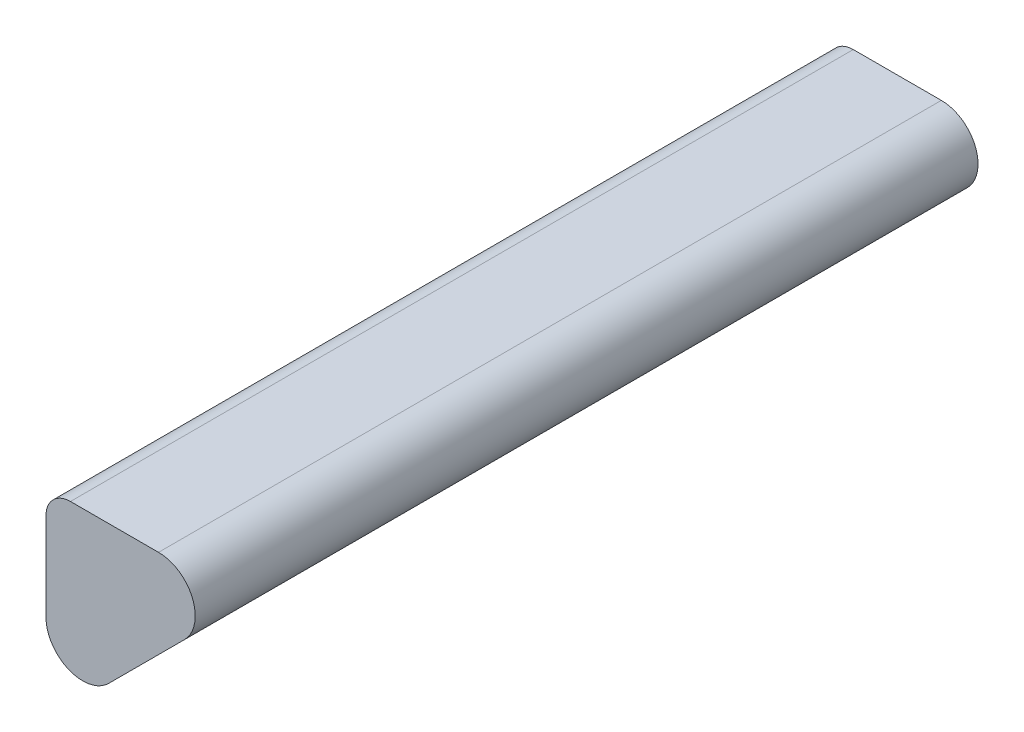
ISO-10303-21;
HEADER;
FILE_DESCRIPTION(('STEP AP214'),'2;1');
FILE_NAME('part.step','',(''),(''),'','','');
FILE_SCHEMA(('AUTOMOTIVE_DESIGN { 1 0 10303 214 1 1 1 1 }'));
ENDSEC;
DATA;
#1=APPLICATION_CONTEXT('core data for automotive mechanical design processes');
#2=APPLICATION_PROTOCOL_DEFINITION('international standard','automotive_design',2000,#1);
#3=PRODUCT_CONTEXT('',#1,'mechanical');
#4=PRODUCT('Part','Part','',(#3));
#5=PRODUCT_RELATED_PRODUCT_CATEGORY('part','',(#4));
#6=PRODUCT_DEFINITION_FORMATION('','',#4);
#7=PRODUCT_DEFINITION_CONTEXT('part definition',#1,'design');
#8=PRODUCT_DEFINITION('design','',#6,#7);
#9=PRODUCT_DEFINITION_SHAPE('','',#8);
#10=(LENGTH_UNIT() NAMED_UNIT(*) SI_UNIT(.MILLI.,.METRE.));
#11=(NAMED_UNIT(*) PLANE_ANGLE_UNIT() SI_UNIT($,.RADIAN.));
#12=(NAMED_UNIT(*) SI_UNIT($,.STERADIAN.) SOLID_ANGLE_UNIT());
#13=UNCERTAINTY_MEASURE_WITH_UNIT(LENGTH_MEASURE(1.E-05),#10,'distance_accuracy_value','');
#14=(GEOMETRIC_REPRESENTATION_CONTEXT(3) GLOBAL_UNCERTAINTY_ASSIGNED_CONTEXT((#13)) GLOBAL_UNIT_ASSIGNED_CONTEXT((#10,
#11,#12)) REPRESENTATION_CONTEXT('',''));
#15=CARTESIAN_POINT('',(0.,0.,0.));
#16=DIRECTION('',(0.,0.,1.));
#17=DIRECTION('',(1.,0.,0.));
#18=AXIS2_PLACEMENT_3D('',#15,#16,#17);
#19=CARTESIAN_POINT('',(-6.50000051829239,3.39949469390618,43.0000000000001));
#20=DIRECTION('',(1.04910532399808E-13,0.,-1.));
#21=DIRECTION('',(-1.,0.,-1.04910532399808E-13));
#22=AXIS2_PLACEMENT_3D('',#19,#20,#21);
#23=CYLINDRICAL_SURFACE('',#22,1.50000000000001);
#24=CARTESIAN_POINT('',(-6.50000051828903,3.39949469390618,11.0000000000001));
#25=DIRECTION('',(1.04910532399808E-13,0.,-1.));
#26=DIRECTION('',(-1.,0.,-1.04910532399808E-13));
#27=AXIS2_PLACEMENT_3D('',#24,#25,#26);
#28=CIRCLE('',#27,1.50000000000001);
#29=CARTESIAN_POINT('',(-5.43934034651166,2.33883452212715,11.));
#30=VERTEX_POINT('',#29);
#31=CARTESIAN_POINT('',(-8.00000051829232,3.39949469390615,10.9999999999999));
#32=VERTEX_POINT('',#31);
#33=EDGE_CURVE('E71',#30,#32,#28,.T.);
#34=ORIENTED_EDGE('',*,*,#33,.F.);
#35=DIRECTION('',(0.,0.,-1.));
#36=VECTOR('',#35,1.);
#37=CARTESIAN_POINT('',(-5.43934034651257,2.33883452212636,42.9999999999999));
#38=LINE('',#37,#36);
#39=CARTESIAN_POINT('',(-5.43934034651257,2.33883452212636,43.));
#40=VERTEX_POINT('',#39);
#41=EDGE_CURVE('E87',#40,#30,#38,.T.);
#42=ORIENTED_EDGE('',*,*,#41,.F.);
#43=CARTESIAN_POINT('',(-6.50000051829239,3.39949469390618,42.9999999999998));
#44=DIRECTION('',(1.04910532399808E-13,0.,-1.));
#45=DIRECTION('',(-1.,0.,-1.04910532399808E-13));
#46=AXIS2_PLACEMENT_3D('',#43,#44,#45);
#47=CIRCLE('',#46,1.50000000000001);
#48=CARTESIAN_POINT('',(-8.00000051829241,3.39949469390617,42.9999999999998));
#49=VERTEX_POINT('',#48);
#50=EDGE_CURVE('E73',#49,#40,#47,.F.);
#51=ORIENTED_EDGE('',*,*,#50,.F.);
#52=DIRECTION('',(0.,0.,1.));
#53=VECTOR('',#52,1.);
#54=CARTESIAN_POINT('',(-8.00000051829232,3.39949469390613,10.9999999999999));
#55=LINE('',#54,#53);
#56=EDGE_CURVE('E20',#32,#49,#55,.T.);
#57=ORIENTED_EDGE('',*,*,#56,.F.);
#58=EDGE_LOOP('',(#34,#42,#51,#57));
#59=FACE_BOUND('',#58,.T.);
#60=ADVANCED_FACE('F16',(#59),#23,.T.);
#61=CARTESIAN_POINT('',(-8.00000051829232,4.11512361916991,9.54638146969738));
#62=DIRECTION('',(-1.,0.,0.));
#63=DIRECTION('',(0.,-0.447213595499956,0.894427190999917));
#64=AXIS2_PLACEMENT_3D('',#61,#62,#63);
#65=PLANE('',#64);
#66=DIRECTION('',(0.,1.,0.));
#67=VECTOR('',#66,1.);
#68=CARTESIAN_POINT('',(-8.00000051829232,3.39949469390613,10.9999999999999));
#69=LINE('',#68,#67);
#70=CARTESIAN_POINT('',(-8.00000051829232,7.00000000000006,10.9999999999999));
#71=VERTEX_POINT('',#70);
#72=EDGE_CURVE('E79',#32,#71,#69,.T.);
#73=ORIENTED_EDGE('',*,*,#72,.F.);
#74=ORIENTED_EDGE('',*,*,#56,.T.);
#75=DIRECTION('',(0.,-1.,0.));
#76=VECTOR('',#75,1.);
#77=CARTESIAN_POINT('',(-8.00000051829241,7.00000000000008,42.9999999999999));
#78=LINE('',#77,#76);
#79=CARTESIAN_POINT('',(-8.0000005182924,7.00000000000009,42.9999999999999));
#80=VERTEX_POINT('',#79);
#81=EDGE_CURVE('E96',#80,#49,#78,.T.);
#82=ORIENTED_EDGE('',*,*,#81,.F.);
#83=DIRECTION('',(0.,0.,1.));
#84=VECTOR('',#83,1.);
#85=CARTESIAN_POINT('',(-8.00000051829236,7.00000000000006,27.));
#86=LINE('',#85,#84);
#87=EDGE_CURVE('E77',#71,#80,#86,.T.);
#88=ORIENTED_EDGE('',*,*,#87,.F.);
#89=EDGE_LOOP('',(#73,#74,#82,#88));
#90=FACE_BOUND('',#89,.T.);
#91=ADVANCED_FACE('F80',(#90),#65,.T.);
#92=CARTESIAN_POINT('',(-7.00000051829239,7.00000000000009,43.));
#93=DIRECTION('',(0.,0.,-1.));
#94=DIRECTION('',(-1.,0.,0.));
#95=AXIS2_PLACEMENT_3D('',#92,#93,#94);
#96=CYLINDRICAL_SURFACE('',#95,0.999999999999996);
#97=CARTESIAN_POINT('',(-7.00000051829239,7.00000000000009,10.9999999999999));
#98=DIRECTION('',(0.,0.,-1.));
#99=DIRECTION('',(-1.,0.,0.));
#100=AXIS2_PLACEMENT_3D('',#97,#98,#99);
#101=CIRCLE('',#100,0.999999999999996);
#102=CARTESIAN_POINT('',(-7.00000051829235,8.00000000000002,10.9999999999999));
#103=VERTEX_POINT('',#102);
#104=EDGE_CURVE('E82',#71,#103,#101,.T.);
#105=ORIENTED_EDGE('',*,*,#104,.F.);
#106=ORIENTED_EDGE('',*,*,#87,.T.);
#107=CARTESIAN_POINT('',(-7.00000051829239,7.00000000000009,42.9999999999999));
#108=DIRECTION('',(0.,0.,-1.));
#109=DIRECTION('',(-1.,0.,0.));
#110=AXIS2_PLACEMENT_3D('',#107,#108,#109);
#111=CIRCLE('',#110,0.999999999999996);
#112=CARTESIAN_POINT('',(-7.00000051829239,8.00000000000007,42.9999999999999));
#113=VERTEX_POINT('',#112);
#114=EDGE_CURVE('E97',#113,#80,#111,.F.);
#115=ORIENTED_EDGE('',*,*,#114,.F.);
#116=DIRECTION('',(0.,0.,1.));
#117=VECTOR('',#116,1.);
#118=CARTESIAN_POINT('',(-7.00000051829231,8.00000000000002,10.9999999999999));
#119=LINE('',#118,#117);
#120=EDGE_CURVE('E111',#103,#113,#119,.T.);
#121=ORIENTED_EDGE('',*,*,#120,.F.);
#122=EDGE_LOOP('',(#105,#106,#115,#121));
#123=FACE_BOUND('',#122,.T.);
#124=ADVANCED_FACE('F118',(#123),#96,.T.);
#125=CARTESIAN_POINT('',(-10.2545262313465,3.51330925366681,42.9999999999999));
#126=DIRECTION('',(0.,0.,1.));
#127=DIRECTION('',(0.894427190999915,-0.447213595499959,0.));
#128=AXIS2_PLACEMENT_3D('',#125,#126,#127);
#129=PLANE('',#128);
#130=ORIENTED_EDGE('',*,*,#50,.T.);
#131=DIRECTION('',(-0.707106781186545,-0.707106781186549,0.));
#132=VECTOR('',#131,1.);
#133=CARTESIAN_POINT('',(-2.3388350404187,5.43933982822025,42.9999999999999));
#134=LINE('',#133,#132);
#135=CARTESIAN_POINT('',(-2.33883504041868,5.43933982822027,42.9999999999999));
#136=VERTEX_POINT('',#135);
#137=EDGE_CURVE('E92',#136,#40,#134,.T.);
#138=ORIENTED_EDGE('',*,*,#137,.F.);
#139=CARTESIAN_POINT('',(-3.39949521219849,6.50000000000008,42.9999999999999));
#140=DIRECTION('',(0.,0.,-1.));
#141=DIRECTION('',(-1.,0.,0.));
#142=AXIS2_PLACEMENT_3D('',#139,#140,#141);
#143=CIRCLE('',#142,1.49999999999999);
#144=CARTESIAN_POINT('',(-3.3994952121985,8.00000000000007,42.9999999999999));
#145=VERTEX_POINT('',#144);
#146=EDGE_CURVE('E108',#145,#136,#143,.T.);
#147=ORIENTED_EDGE('',*,*,#146,.F.);
#148=DIRECTION('',(1.,0.,0.));
#149=VECTOR('',#148,1.);
#150=CARTESIAN_POINT('',(-7.00000051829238,8.00000000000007,42.9999999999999));
#151=LINE('',#150,#149);
#152=EDGE_CURVE('E115',#113,#145,#151,.T.);
#153=ORIENTED_EDGE('',*,*,#152,.F.);
#154=ORIENTED_EDGE('',*,*,#114,.T.);
#155=ORIENTED_EDGE('',*,*,#81,.T.);
#156=EDGE_LOOP('',(#130,#138,#147,#153,#154,#155));
#157=FACE_BOUND('',#156,.T.);
#158=ADVANCED_FACE('F126',(#157),#129,.T.);
#159=CARTESIAN_POINT('',(-14.1760242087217,-6.39784934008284,37.1865995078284));
#160=DIRECTION('',(0.707106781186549,-0.707106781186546,0.));
#161=DIRECTION('',(0.301511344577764,0.301511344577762,-0.904534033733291));
#162=AXIS2_PLACEMENT_3D('',#159,#160,#161);
#163=PLANE('',#162);
#164=DIRECTION('',(-0.707106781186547,-0.707106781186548,0.));
#165=VECTOR('',#164,1.);
#166=CARTESIAN_POINT('',(-2.3388350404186,5.43933982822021,10.9999999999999));
#167=LINE('',#166,#165);
#168=CARTESIAN_POINT('',(-2.33883504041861,5.4393398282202,10.9999999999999));
#169=VERTEX_POINT('',#168);
#170=EDGE_CURVE('E85',#169,#30,#167,.T.);
#171=ORIENTED_EDGE('',*,*,#170,.F.);
#172=DIRECTION('',(0.,0.,-1.));
#173=VECTOR('',#172,1.);
#174=CARTESIAN_POINT('',(-2.33883504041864,5.43933982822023,27.));
#175=LINE('',#174,#173);
#176=EDGE_CURVE('E107',#136,#169,#175,.T.);
#177=ORIENTED_EDGE('',*,*,#176,.F.);
#178=ORIENTED_EDGE('',*,*,#137,.T.);
#179=ORIENTED_EDGE('',*,*,#41,.T.);
#180=EDGE_LOOP('',(#171,#177,#178,#179));
#181=FACE_BOUND('',#180,.T.);
#182=ADVANCED_FACE('F125',(#181),#163,.T.);
#183=CARTESIAN_POINT('',(-4.39995704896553,0.586024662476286,10.9999999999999));
#184=DIRECTION('',(0.,0.,-1.));
#185=DIRECTION('',(-0.894427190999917,0.447213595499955,0.));
#186=AXIS2_PLACEMENT_3D('',#183,#184,#185);
#187=PLANE('',#186);
#188=ORIENTED_EDGE('',*,*,#72,.T.);
#189=ORIENTED_EDGE('',*,*,#104,.T.);
#190=DIRECTION('',(-1.,0.,0.));
#191=VECTOR('',#190,1.);
#192=CARTESIAN_POINT('',(-3.39949521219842,8.00000000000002,10.9999999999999));
#193=LINE('',#192,#191);
#194=CARTESIAN_POINT('',(-3.39949521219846,8.00000000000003,10.9999999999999));
#195=VERTEX_POINT('',#194);
#196=EDGE_CURVE('E35',#195,#103,#193,.T.);
#197=ORIENTED_EDGE('',*,*,#196,.F.);
#198=CARTESIAN_POINT('',(-3.39949521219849,6.50000000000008,10.9999999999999));
#199=DIRECTION('',(0.,0.,-1.));
#200=DIRECTION('',(-1.,0.,0.));
#201=AXIS2_PLACEMENT_3D('',#198,#199,#200);
#202=CIRCLE('',#201,1.49999999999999);
#203=EDGE_CURVE('E26',#169,#195,#202,.F.);
#204=ORIENTED_EDGE('',*,*,#203,.F.);
#205=ORIENTED_EDGE('',*,*,#170,.T.);
#206=ORIENTED_EDGE('',*,*,#33,.T.);
#207=EDGE_LOOP('',(#188,#189,#197,#204,#205,#206));
#208=FACE_BOUND('',#207,.T.);
#209=ADVANCED_FACE('F84',(#208),#187,.T.);
#210=CARTESIAN_POINT('',(-5.19974786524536,8.00000000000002,9.18560521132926));
#211=DIRECTION('',(0.,1.,0.));
#212=DIRECTION('',(-0.70710678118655,0.,0.707106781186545));
#213=AXIS2_PLACEMENT_3D('',#210,#211,#212);
#214=PLANE('',#213);
#215=ORIENTED_EDGE('',*,*,#196,.T.);
#216=ORIENTED_EDGE('',*,*,#120,.T.);
#217=ORIENTED_EDGE('',*,*,#152,.T.);
#218=DIRECTION('',(0.,0.,1.));
#219=VECTOR('',#218,1.);
#220=CARTESIAN_POINT('',(-3.39949521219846,8.00000000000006,27.));
#221=LINE('',#220,#219);
#222=EDGE_CURVE('E11',#195,#145,#221,.T.);
#223=ORIENTED_EDGE('',*,*,#222,.F.);
#224=EDGE_LOOP('',(#215,#216,#217,#223));
#225=FACE_BOUND('',#224,.T.);
#226=ADVANCED_FACE('F120',(#225),#214,.T.);
#227=CARTESIAN_POINT('',(-3.39949521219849,6.50000000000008,43.));
#228=DIRECTION('',(0.,0.,-1.));
#229=DIRECTION('',(-1.,0.,0.));
#230=AXIS2_PLACEMENT_3D('',#227,#228,#229);
#231=CYLINDRICAL_SURFACE('',#230,1.49999999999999);
#232=ORIENTED_EDGE('',*,*,#203,.T.);
#233=ORIENTED_EDGE('',*,*,#222,.T.);
#234=ORIENTED_EDGE('',*,*,#146,.T.);
#235=ORIENTED_EDGE('',*,*,#176,.T.);
#236=EDGE_LOOP('',(#232,#233,#234,#235));
#237=FACE_BOUND('',#236,.T.);
#238=ADVANCED_FACE('F18',(#237),#231,.T.);
#239=CLOSED_SHELL('',(#60,#91,#124,#158,#182,#209,#226,#238));
#240=MANIFOLD_SOLID_BREP('B1',#239);
#241=ADVANCED_BREP_SHAPE_REPRESENTATION('',(#18,#240),#14);
#242=SHAPE_DEFINITION_REPRESENTATION(#9,#241);
ENDSEC;
END-ISO-10303-21;
